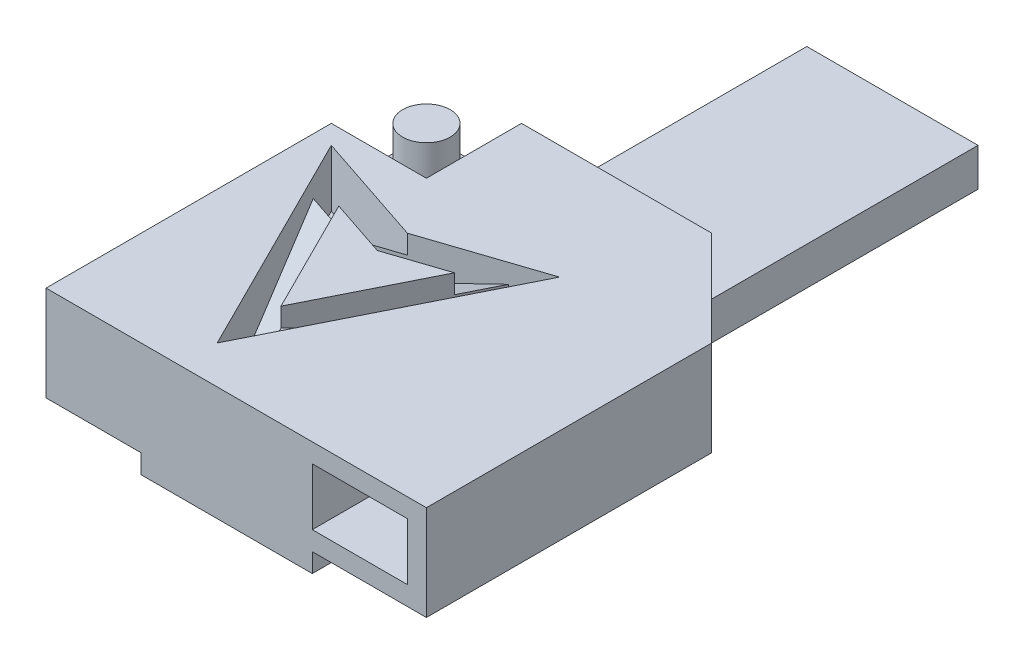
from build123d import *

# Parameters (mm, degrees)
SALIENTE_EXTRUIR1_DEPTH       = 5
CROQUIS2_W                    = 5
CROQUIS2_H                    = 5
CROQUIS2_R                    = 1.25
CORTAR_EXTRUIR4_DEPTH         = 3
SALIENTE_EXTRUIR9_DEPTH       = 2.121320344
SALIENTE_EXTRUIR10_DEPTH      = 2.5
SALIENTE_EXTRUIR11_DEPTH      = 2.121320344
SALIENTE_EXTRUIR12_DEPTH      = 1.875
CROQUIS19_W                   = 5
CROQUIS19_H                   = 3
CORTAR_EXTRUIR5_DEPTH         = 23.912878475
SALIENTE_EXTRUIR13_DEPTH      = 15
SALIENTE_EXTRUIR13_DEPTH_BACK = 20
CROQUIS21_W                   = 9
CROQUIS21_H                   = 2


with BuildPart() as part:
    # Croquis1 → Saliente-Extruir1 (new body)
    with BuildSketch(Plane(origin=(0, 0, 0), x_dir=(1, 0, 0), z_dir=(0, 1, 0))):
        Polygon((5, 10), (10, 5), (10, -10), (-10, -10), (-10, 10), align=None)
    extrude(amount=SALIENTE_EXTRUIR1_DEPTH)

    # Croquis2 → Cortar-Extruir4 (cut)
    # profile 1 of 2: a face of its own
    with BuildSketch(Plane(origin=(0, 5, 0), x_dir=(1, 0, 0), z_dir=(0, 1, 0))):
        Polygon((3, 4), (-3, -8), (-9, 4), (-3, 2), align=None)
        Polygon((-6.038855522, 1.431813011), (-3, 0.41886117), (0.038855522, 1.431813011), (-3, -4.645898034), align=None, mode=Mode.SUBTRACT)
    # profile 2 of 2: a face of its own
    with BuildSketch(Plane(origin=(0, 5, 0), x_dir=(1, 0, 0), z_dir=(0, 1, 0))):
        with Locations((-7.5, 7.5)):
            Rectangle(CROQUIS2_W, CROQUIS2_H)
        with Locations(Location((-7.5, 7.5, 0), (0, 0, 270))):
            Circle(CROQUIS2_R, mode=Mode.SUBTRACT)
    extrude(amount=-CORTAR_EXTRUIR4_DEPTH, mode=Mode.SUBTRACT)

    # Croquis15 → Saliente-Extruir9 (add, along a direction that is not the sketch's normal)
    with BuildSketch(Plane(origin=(-4.258359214, 0, 2.129179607), x_dir=(0.4472135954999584, 0, 0.8944271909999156), z_dir=(-0.8944271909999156, 0, 0.4472135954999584))):
        Polygon((4.688776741, 2), (-3.98131078, 2), (-3.98131078, 4), align=None)
    extrude(amount=SALIENTE_EXTRUIR9_DEPTH, dir=(-0.9486832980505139, 0, -0.316227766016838))

    # Croquis16 → Saliente-Extruir10 (add, along a direction that is not the sketch's normal)
    with BuildSketch(Plane(origin=(-0.174341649, 0, 0.523024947), x_dir=(-0.948683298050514, 0, -0.31622776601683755), z_dir=(0.3162277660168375, 0, -0.9486832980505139))):
        Polygon((5.478505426, 2), (8.303060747, 2), (5.478505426, 4), align=None)
    extrude(amount=SALIENTE_EXTRUIR10_DEPTH, dir=(0.9486832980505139, 0, -0.31622776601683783))

    # Croquis17 → Saliente-Extruir11 (add, along a direction that is not the sketch's normal)
    with BuildSketch(Plane(origin=(-0.9, 0, -2.7), x_dir=(0.9486832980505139, 0, -0.3162277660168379), z_dir=(0.3162277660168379, 0, 0.9486832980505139))):
        Polygon((-4.713594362, 2), (1.989640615, 4), (1.989640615, 2), align=None)
    extrude(amount=SALIENTE_EXTRUIR11_DEPTH, dir=(-0.447213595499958, 0, 0.894427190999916))

    # Croquis18 → Saliente-Extruir12 (add, along a direction that is not the sketch's normal)
    with BuildSketch(Plane(origin=(-0.541640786, 0, -0.270820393), x_dir=(0.4472135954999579, 0, -0.894427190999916), z_dir=(0.894427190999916, 0, 0.4472135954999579))):
        Polygon((-5.497058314, 4), (-5.497058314, 2), (3.41934955, 2), align=None)
    extrude(amount=SALIENTE_EXTRUIR12_DEPTH, dir=(0.4472135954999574, 0, 0.8944271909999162))

    # Croquis19 → Cortar-Extruir5 (cut, through all)
    with BuildSketch(Plane.XY.offset(10)):
        with Locations((6.5, 2.5)):
            Rectangle(CROQUIS19_W, CROQUIS19_H)
    extrude(amount=-CORTAR_EXTRUIR5_DEPTH, mode=Mode.SUBTRACT)

    # Croquis21 → Saliente-Extruir13 (add, two sides: drawn at the far end of the back side and taken through both)
    with BuildSketch(Plane(origin=(0, 0, -10), x_dir=(-1, 0, 0), z_dir=(0, 0, -1)).offset(-SALIENTE_EXTRUIR13_DEPTH_BACK)):
        with Locations((0.5, 0)):
            Rectangle(CROQUIS21_W, CROQUIS21_H)
    extrude(amount=SALIENTE_EXTRUIR13_DEPTH + SALIENTE_EXTRUIR13_DEPTH_BACK)


solid = part.part
